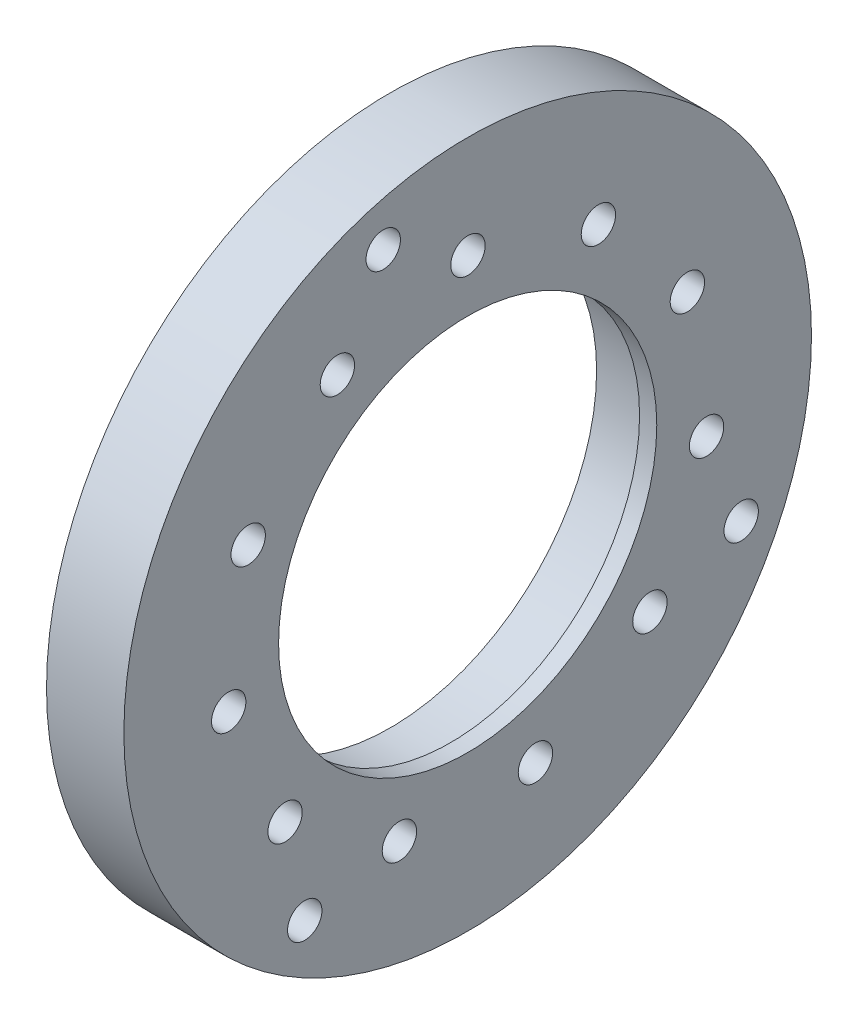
ISO-10303-21;
HEADER;
FILE_DESCRIPTION(('STEP AP214'),'2;1');
FILE_NAME('part.step','',(''),(''),'','','');
FILE_SCHEMA(('AUTOMOTIVE_DESIGN { 1 0 10303 214 1 1 1 1 }'));
ENDSEC;
DATA;
#1=APPLICATION_CONTEXT('core data for automotive mechanical design processes');
#2=APPLICATION_PROTOCOL_DEFINITION('international standard','automotive_design',2000,#1);
#3=PRODUCT_CONTEXT('',#1,'mechanical');
#4=PRODUCT('Part','Part','',(#3));
#5=PRODUCT_RELATED_PRODUCT_CATEGORY('part','',(#4));
#6=PRODUCT_DEFINITION_FORMATION('','',#4);
#7=PRODUCT_DEFINITION_CONTEXT('part definition',#1,'design');
#8=PRODUCT_DEFINITION('design','',#6,#7);
#9=PRODUCT_DEFINITION_SHAPE('','',#8);
#10=(LENGTH_UNIT() NAMED_UNIT(*) SI_UNIT(.MILLI.,.METRE.));
#11=(NAMED_UNIT(*) PLANE_ANGLE_UNIT() SI_UNIT($,.RADIAN.));
#12=(NAMED_UNIT(*) SI_UNIT($,.STERADIAN.) SOLID_ANGLE_UNIT());
#13=UNCERTAINTY_MEASURE_WITH_UNIT(LENGTH_MEASURE(1.E-05),#10,'distance_accuracy_value','');
#14=(GEOMETRIC_REPRESENTATION_CONTEXT(3) GLOBAL_UNCERTAINTY_ASSIGNED_CONTEXT((#13)) GLOBAL_UNIT_ASSIGNED_CONTEXT((#10,
#11,#12)) REPRESENTATION_CONTEXT('',''));
#15=CARTESIAN_POINT('',(0.,0.,0.));
#16=DIRECTION('',(0.,0.,1.));
#17=DIRECTION('',(1.,0.,0.));
#18=AXIS2_PLACEMENT_3D('',#15,#16,#17);
#19=CARTESIAN_POINT('',(63.,40.,0.));
#20=DIRECTION('',(1.,0.,0.));
#21=DIRECTION('',(0.,0.,-1.));
#22=AXIS2_PLACEMENT_3D('',#19,#20,#21);
#23=PLANE('',#22);
#24=CARTESIAN_POINT('',(63.,33.5933023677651,9.82293418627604));
#25=DIRECTION('',(1.,0.,0.));
#26=DIRECTION('',(0.,0.,-1.));
#27=AXIS2_PLACEMENT_3D('',#24,#25,#26);
#28=CIRCLE('',#27,2.);
#29=CARTESIAN_POINT('',(63.,33.5933023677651,7.82293418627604));
#30=VERTEX_POINT('',#29);
#31=EDGE_CURVE('E420',#30,#30,#28,.T.);
#32=ORIENTED_EDGE('',*,*,#31,.F.);
#33=EDGE_LOOP('',(#32));
#34=FACE_BOUND('',#33,.T.);
#35=CARTESIAN_POINT('',(63.,-29.4226129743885,18.9554700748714));
#36=DIRECTION('',(1.,0.,0.));
#37=DIRECTION('',(0.,0.,-1.));
#38=AXIS2_PLACEMENT_3D('',#35,#36,#37);
#39=CIRCLE('',#38,2.);
#40=CARTESIAN_POINT('',(63.,-29.4226129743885,16.9554700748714));
#41=VERTEX_POINT('',#40);
#42=EDGE_CURVE('E432',#41,#41,#39,.T.);
#43=ORIENTED_EDGE('',*,*,#42,.F.);
#44=EDGE_LOOP('',(#43));
#45=FACE_BOUND('',#44,.T.);
#46=CARTESIAN_POINT('',(63.,-14.5752563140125,-31.8207778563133));
#47=DIRECTION('',(1.,0.,0.));
#48=DIRECTION('',(0.,0.,-1.));
#49=AXIS2_PLACEMENT_3D('',#46,#47,#48);
#50=CIRCLE('',#49,2.);
#51=CARTESIAN_POINT('',(63.,-14.5752563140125,-33.8207778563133));
#52=VERTEX_POINT('',#51);
#53=EDGE_CURVE('E444',#52,#52,#50,.T.);
#54=ORIENTED_EDGE('',*,*,#53,.F.);
#55=EDGE_LOOP('',(#54));
#56=FACE_BOUND('',#55,.T.);
#57=CARTESIAN_POINT('',(63.,23.6087778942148,-15.2099163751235));
#58=DIRECTION('',(-1.,0.,0.));
#59=DIRECTION('',(0.,0.,1.));
#60=AXIS2_PLACEMENT_3D('',#57,#58,#59);
#61=CIRCLE('',#60,2.);
#62=CARTESIAN_POINT('',(63.,23.6087778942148,-13.2099163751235));
#63=VERTEX_POINT('',#62);
#64=EDGE_CURVE('E450',#63,#63,#61,.T.);
#65=ORIENTED_EDGE('',*,*,#64,.T.);
#66=EDGE_LOOP('',(#65));
#67=FACE_BOUND('',#66,.T.);
#68=CARTESIAN_POINT('',(63.,11.6378661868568,-25.5592648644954));
#69=DIRECTION('',(-1.,0.,0.));
#70=DIRECTION('',(0.,0.,1.));
#71=AXIS2_PLACEMENT_3D('',#68,#69,#70);
#72=CIRCLE('',#71,2.00000000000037);
#73=CARTESIAN_POINT('',(63.,11.6378661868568,-23.559264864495));
#74=VERTEX_POINT('',#73);
#75=EDGE_CURVE('E456',#74,#74,#72,.T.);
#76=ORIENTED_EDGE('',*,*,#75,.T.);
#77=EDGE_LOOP('',(#76));
#78=FACE_BOUND('',#77,.T.);
#79=CARTESIAN_POINT('',(63.,-4.02798580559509,-27.7937273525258));
#80=DIRECTION('',(-1.,0.,0.));
#81=DIRECTION('',(0.,0.,1.));
#82=AXIS2_PLACEMENT_3D('',#79,#80,#81);
#83=CIRCLE('',#82,2.00000000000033);
#84=CARTESIAN_POINT('',(63.,-4.02798580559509,-25.7937273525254));
#85=VERTEX_POINT('',#84);
#86=EDGE_CURVE('E462',#85,#85,#83,.T.);
#87=ORIENTED_EDGE('',*,*,#86,.T.);
#88=EDGE_LOOP('',(#87));
#89=FACE_BOUND('',#88,.T.);
#90=CARTESIAN_POINT('',(63.,-18.4149807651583,-21.2038777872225));
#91=DIRECTION('',(-1.,0.,0.));
#92=DIRECTION('',(0.,0.,1.));
#93=AXIS2_PLACEMENT_3D('',#90,#91,#92);
#94=CIRCLE('',#93,2.00000000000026);
#95=CARTESIAN_POINT('',(63.,-18.4149807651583,-19.2038777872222));
#96=VERTEX_POINT('',#95);
#97=EDGE_CURVE('E468',#96,#96,#94,.T.);
#98=ORIENTED_EDGE('',*,*,#97,.T.);
#99=EDGE_LOOP('',(#98));
#100=FACE_BOUND('',#99,.T.);
#101=CARTESIAN_POINT('',(63.,-26.9553494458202,-7.88194684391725));
#102=DIRECTION('',(-1.,0.,0.));
#103=DIRECTION('',(0.,0.,1.));
#104=AXIS2_PLACEMENT_3D('',#101,#102,#103);
#105=CIRCLE('',#104,2.00000000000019);
#106=CARTESIAN_POINT('',(63.,-26.9553494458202,-5.88194684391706));
#107=VERTEX_POINT('',#106);
#108=EDGE_CURVE('E474',#107,#107,#105,.T.);
#109=ORIENTED_EDGE('',*,*,#108,.T.);
#110=EDGE_LOOP('',(#109));
#111=FACE_BOUND('',#110,.T.);
#112=CARTESIAN_POINT('',(63.,-26.9375851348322,7.94244653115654));
#113=DIRECTION('',(-1.,0.,0.));
#114=DIRECTION('',(0.,0.,1.));
#115=AXIS2_PLACEMENT_3D('',#112,#113,#114);
#116=CIRCLE('',#115,2.00000000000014);
#117=CARTESIAN_POINT('',(63.,-26.9375851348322,9.94244653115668));
#118=VERTEX_POINT('',#117);
#119=EDGE_CURVE('E480',#118,#118,#116,.T.);
#120=ORIENTED_EDGE('',*,*,#119,.T.);
#121=EDGE_LOOP('',(#120));
#122=FACE_BOUND('',#121,.T.);
#123=CARTESIAN_POINT('',(63.,-18.3673278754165,21.2451692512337));
#124=DIRECTION('',(-1.,0.,0.));
#125=DIRECTION('',(0.,0.,1.));
#126=AXIS2_PLACEMENT_3D('',#123,#124,#125);
#127=CIRCLE('',#126,2.00000000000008);
#128=CARTESIAN_POINT('',(63.,-18.3673278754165,23.2451692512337));
#129=VERTEX_POINT('',#128);
#130=EDGE_CURVE('E486',#129,#129,#127,.T.);
#131=ORIENTED_EDGE('',*,*,#130,.T.);
#132=EDGE_LOOP('',(#131));
#133=FACE_BOUND('',#132,.T.);
#134=CARTESIAN_POINT('',(63.,-3.96557379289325,27.8027008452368));
#135=DIRECTION('',(-1.,0.,0.));
#136=DIRECTION('',(0.,0.,1.));
#137=AXIS2_PLACEMENT_3D('',#134,#135,#136);
#138=CIRCLE('',#137,2.00000000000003);
#139=CARTESIAN_POINT('',(63.,-3.96557379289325,29.8027008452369));
#140=VERTEX_POINT('',#139);
#141=EDGE_CURVE('E492',#140,#140,#138,.T.);
#142=ORIENTED_EDGE('',*,*,#141,.T.);
#143=EDGE_LOOP('',(#142));
#144=FACE_BOUND('',#143,.T.);
#145=CARTESIAN_POINT('',(63.,11.6952219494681,25.5330713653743));
#146=DIRECTION('',(-1.,0.,0.));
#147=DIRECTION('',(0.,0.,1.));
#148=AXIS2_PLACEMENT_3D('',#145,#146,#147);
#149=CIRCLE('',#148,2.00000000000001);
#150=CARTESIAN_POINT('',(63.,11.6952219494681,27.5330713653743));
#151=VERTEX_POINT('',#150);
#152=EDGE_CURVE('E498',#151,#151,#149,.T.);
#153=ORIENTED_EDGE('',*,*,#152,.T.);
#154=EDGE_LOOP('',(#153));
#155=FACE_BOUND('',#154,.T.);
#156=CARTESIAN_POINT('',(63.,23.6428673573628,15.1568721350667));
#157=DIRECTION('',(-1.,0.,0.));
#158=DIRECTION('',(0.,0.,1.));
#159=AXIS2_PLACEMENT_3D('',#156,#157,#158);
#160=CIRCLE('',#159,2.);
#161=CARTESIAN_POINT('',(63.,23.6428673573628,17.1568721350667));
#162=VERTEX_POINT('',#161);
#163=EDGE_CURVE('E504',#162,#162,#160,.T.);
#164=ORIENTED_EDGE('',*,*,#163,.T.);
#165=EDGE_LOOP('',(#164));
#166=FACE_BOUND('',#165,.T.);
#167=CARTESIAN_POINT('',(63.,28.0840694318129,-0.0315269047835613));
#168=DIRECTION('',(-1.,0.,0.));
#169=DIRECTION('',(0.,0.,1.));
#170=AXIS2_PLACEMENT_3D('',#167,#168,#169);
#171=CIRCLE('',#170,2.);
#172=CARTESIAN_POINT('',(63.,28.0840694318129,1.96847309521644));
#173=VERTEX_POINT('',#172);
#174=EDGE_CURVE('E510',#173,#173,#171,.T.);
#175=ORIENTED_EDGE('',*,*,#174,.T.);
#176=EDGE_LOOP('',(#175));
#177=FACE_BOUND('',#176,.T.);
#178=CARTESIAN_POINT('',(63.,0.,0.));
#179=DIRECTION('',(1.,0.,0.));
#180=DIRECTION('',(0.,0.,-1.));
#181=AXIS2_PLACEMENT_3D('',#178,#179,#180);
#182=CIRCLE('',#181,40.);
#183=CARTESIAN_POINT('',(63.,0.,-40.));
#184=VERTEX_POINT('',#183);
#185=EDGE_CURVE('E11',#184,#184,#182,.T.);
#186=ORIENTED_EDGE('',*,*,#185,.T.);
#187=EDGE_LOOP('',(#186));
#188=FACE_BOUND('',#187,.T.);
#189=CARTESIAN_POINT('',(63.,0.,0.));
#190=DIRECTION('',(1.,0.,0.));
#191=DIRECTION('',(0.,0.,-1.));
#192=AXIS2_PLACEMENT_3D('',#189,#190,#191);
#193=CIRCLE('',#192,22.);
#194=CARTESIAN_POINT('',(63.,0.,-22.));
#195=VERTEX_POINT('',#194);
#196=EDGE_CURVE('E513',#195,#195,#193,.T.);
#197=ORIENTED_EDGE('',*,*,#196,.F.);
#198=EDGE_LOOP('',(#197));
#199=FACE_BOUND('',#198,.T.);
#200=ADVANCED_FACE('F368',(#34,#45,#56,#67,#78,#89,#100,#111,#122,#133,#144,#155,#166,#177,#188,
#199),#23,.T.);
#201=CARTESIAN_POINT('',(53.,0.,0.));
#202=DIRECTION('',(1.,0.,0.));
#203=DIRECTION('',(0.,0.,-1.));
#204=AXIS2_PLACEMENT_3D('',#201,#202,#203);
#205=CYLINDRICAL_SURFACE('',#204,40.);
#206=CARTESIAN_POINT('',(54.,0.,0.));
#207=DIRECTION('',(1.,0.,0.));
#208=DIRECTION('',(0.,0.,-1.));
#209=AXIS2_PLACEMENT_3D('',#206,#207,#208);
#210=CIRCLE('',#209,40.);
#211=CARTESIAN_POINT('',(54.,0.,-40.));
#212=VERTEX_POINT('',#211);
#213=EDGE_CURVE('E375',#212,#212,#210,.T.);
#214=ORIENTED_EDGE('',*,*,#213,.T.);
#215=EDGE_LOOP('',(#214));
#216=FACE_BOUND('',#215,.T.);
#217=ORIENTED_EDGE('',*,*,#185,.F.);
#218=EDGE_LOOP('',(#217));
#219=FACE_BOUND('',#218,.T.);
#220=ADVANCED_FACE('F527',(#216,#219),#205,.T.);
#221=CARTESIAN_POINT('',(54.,40.,0.));
#222=DIRECTION('',(-1.,0.,0.));
#223=DIRECTION('',(0.,0.,1.));
#224=AXIS2_PLACEMENT_3D('',#221,#222,#223);
#225=PLANE('',#224);
#226=CARTESIAN_POINT('',(54.,26.9098547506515,-26.1172302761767));
#227=DIRECTION('',(-1.,0.,0.));
#228=DIRECTION('',(0.,0.,1.));
#229=AXIS2_PLACEMENT_3D('',#226,#227,#228);
#230=CIRCLE('',#229,1.25);
#231=CARTESIAN_POINT('',(54.,26.9098547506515,-24.8672302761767));
#232=VERTEX_POINT('',#231);
#233=EDGE_CURVE('E394',#232,#232,#230,.T.);
#234=ORIENTED_EDGE('',*,*,#233,.F.);
#235=EDGE_LOOP('',(#234));
#236=FACE_BOUND('',#235,.T.);
#237=CARTESIAN_POINT('',(54.,-18.4617424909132,32.6406811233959));
#238=DIRECTION('',(-1.,0.,0.));
#239=DIRECTION('',(0.,0.,1.));
#240=AXIS2_PLACEMENT_3D('',#237,#238,#239);
#241=CIRCLE('',#240,1.25);
#242=CARTESIAN_POINT('',(54.,-18.4617424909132,33.8906811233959));
#243=VERTEX_POINT('',#242);
#244=EDGE_CURVE('E402',#243,#243,#241,.T.);
#245=ORIENTED_EDGE('',*,*,#244,.F.);
#246=EDGE_LOOP('',(#245));
#247=FACE_BOUND('',#246,.T.);
#248=CARTESIAN_POINT('',(54.,-29.6810661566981,-22.9190818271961));
#249=DIRECTION('',(-1.,0.,0.));
#250=DIRECTION('',(0.,0.,1.));
#251=AXIS2_PLACEMENT_3D('',#248,#249,#250);
#252=CIRCLE('',#251,1.25);
#253=CARTESIAN_POINT('',(54.,-29.6810661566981,-21.6690818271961));
#254=VERTEX_POINT('',#253);
#255=EDGE_CURVE('E408',#254,#254,#252,.T.);
#256=ORIENTED_EDGE('',*,*,#255,.F.);
#257=EDGE_LOOP('',(#256));
#258=FACE_BOUND('',#257,.T.);
#259=CARTESIAN_POINT('',(54.,33.5933023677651,9.82293418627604));
#260=DIRECTION('',(-1.,0.,0.));
#261=DIRECTION('',(0.,0.,1.));
#262=AXIS2_PLACEMENT_3D('',#259,#260,#261);
#263=CIRCLE('',#262,3.25);
#264=CARTESIAN_POINT('',(54.,33.5933023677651,13.072934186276));
#265=VERTEX_POINT('',#264);
#266=EDGE_CURVE('E417',#265,#265,#263,.T.);
#267=ORIENTED_EDGE('',*,*,#266,.F.);
#268=EDGE_LOOP('',(#267));
#269=FACE_BOUND('',#268,.T.);
#270=CARTESIAN_POINT('',(54.,-29.4226129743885,18.9554700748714));
#271=DIRECTION('',(-1.,0.,0.));
#272=DIRECTION('',(0.,0.,1.));
#273=AXIS2_PLACEMENT_3D('',#270,#271,#272);
#274=CIRCLE('',#273,3.25);
#275=CARTESIAN_POINT('',(54.,-29.4226129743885,22.2054700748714));
#276=VERTEX_POINT('',#275);
#277=EDGE_CURVE('E429',#276,#276,#274,.T.);
#278=ORIENTED_EDGE('',*,*,#277,.F.);
#279=EDGE_LOOP('',(#278));
#280=FACE_BOUND('',#279,.T.);
#281=CARTESIAN_POINT('',(54.,-14.5752563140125,-31.8207778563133));
#282=DIRECTION('',(-1.,0.,0.));
#283=DIRECTION('',(0.,0.,1.));
#284=AXIS2_PLACEMENT_3D('',#281,#282,#283);
#285=CIRCLE('',#284,3.25);
#286=CARTESIAN_POINT('',(54.,-14.5752563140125,-28.5707778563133));
#287=VERTEX_POINT('',#286);
#288=EDGE_CURVE('E441',#287,#287,#285,.T.);
#289=ORIENTED_EDGE('',*,*,#288,.F.);
#290=EDGE_LOOP('',(#289));
#291=FACE_BOUND('',#290,.T.);
#292=CARTESIAN_POINT('',(54.,23.6087778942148,-15.2099163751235));
#293=DIRECTION('',(-1.,0.,0.));
#294=DIRECTION('',(0.,0.,1.));
#295=AXIS2_PLACEMENT_3D('',#292,#293,#294);
#296=CIRCLE('',#295,2.);
#297=CARTESIAN_POINT('',(54.,23.6087778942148,-13.2099163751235));
#298=VERTEX_POINT('',#297);
#299=EDGE_CURVE('E447',#298,#298,#296,.T.);
#300=ORIENTED_EDGE('',*,*,#299,.F.);
#301=EDGE_LOOP('',(#300));
#302=FACE_BOUND('',#301,.T.);
#303=CARTESIAN_POINT('',(54.,11.6378661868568,-25.5592648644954));
#304=DIRECTION('',(-1.,0.,0.));
#305=DIRECTION('',(0.,0.,1.));
#306=AXIS2_PLACEMENT_3D('',#303,#304,#305);
#307=CIRCLE('',#306,2.00000000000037);
#308=CARTESIAN_POINT('',(54.,11.6378661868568,-23.559264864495));
#309=VERTEX_POINT('',#308);
#310=EDGE_CURVE('E453',#309,#309,#307,.T.);
#311=ORIENTED_EDGE('',*,*,#310,.F.);
#312=EDGE_LOOP('',(#311));
#313=FACE_BOUND('',#312,.T.);
#314=CARTESIAN_POINT('',(54.,-4.02798580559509,-27.7937273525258));
#315=DIRECTION('',(-1.,0.,0.));
#316=DIRECTION('',(0.,0.,1.));
#317=AXIS2_PLACEMENT_3D('',#314,#315,#316);
#318=CIRCLE('',#317,2.00000000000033);
#319=CARTESIAN_POINT('',(54.,-4.02798580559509,-25.7937273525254));
#320=VERTEX_POINT('',#319);
#321=EDGE_CURVE('E459',#320,#320,#318,.T.);
#322=ORIENTED_EDGE('',*,*,#321,.F.);
#323=EDGE_LOOP('',(#322));
#324=FACE_BOUND('',#323,.T.);
#325=CARTESIAN_POINT('',(54.,-18.4149807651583,-21.2038777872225));
#326=DIRECTION('',(-1.,0.,0.));
#327=DIRECTION('',(0.,0.,1.));
#328=AXIS2_PLACEMENT_3D('',#325,#326,#327);
#329=CIRCLE('',#328,2.00000000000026);
#330=CARTESIAN_POINT('',(54.,-18.4149807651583,-19.2038777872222));
#331=VERTEX_POINT('',#330);
#332=EDGE_CURVE('E465',#331,#331,#329,.T.);
#333=ORIENTED_EDGE('',*,*,#332,.F.);
#334=EDGE_LOOP('',(#333));
#335=FACE_BOUND('',#334,.T.);
#336=CARTESIAN_POINT('',(54.,-26.9553494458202,-7.88194684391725));
#337=DIRECTION('',(-1.,0.,0.));
#338=DIRECTION('',(0.,0.,1.));
#339=AXIS2_PLACEMENT_3D('',#336,#337,#338);
#340=CIRCLE('',#339,2.00000000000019);
#341=CARTESIAN_POINT('',(54.,-26.9553494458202,-5.88194684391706));
#342=VERTEX_POINT('',#341);
#343=EDGE_CURVE('E471',#342,#342,#340,.T.);
#344=ORIENTED_EDGE('',*,*,#343,.F.);
#345=EDGE_LOOP('',(#344));
#346=FACE_BOUND('',#345,.T.);
#347=CARTESIAN_POINT('',(54.,-26.9375851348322,7.94244653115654));
#348=DIRECTION('',(-1.,0.,0.));
#349=DIRECTION('',(0.,0.,1.));
#350=AXIS2_PLACEMENT_3D('',#347,#348,#349);
#351=CIRCLE('',#350,2.00000000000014);
#352=CARTESIAN_POINT('',(54.,-26.9375851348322,9.94244653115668));
#353=VERTEX_POINT('',#352);
#354=EDGE_CURVE('E477',#353,#353,#351,.T.);
#355=ORIENTED_EDGE('',*,*,#354,.F.);
#356=EDGE_LOOP('',(#355));
#357=FACE_BOUND('',#356,.T.);
#358=CARTESIAN_POINT('',(54.,-18.3673278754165,21.2451692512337));
#359=DIRECTION('',(-1.,0.,0.));
#360=DIRECTION('',(0.,0.,1.));
#361=AXIS2_PLACEMENT_3D('',#358,#359,#360);
#362=CIRCLE('',#361,2.00000000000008);
#363=CARTESIAN_POINT('',(54.,-18.3673278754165,23.2451692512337));
#364=VERTEX_POINT('',#363);
#365=EDGE_CURVE('E483',#364,#364,#362,.T.);
#366=ORIENTED_EDGE('',*,*,#365,.F.);
#367=EDGE_LOOP('',(#366));
#368=FACE_BOUND('',#367,.T.);
#369=CARTESIAN_POINT('',(54.,-3.96557379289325,27.8027008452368));
#370=DIRECTION('',(-1.,0.,0.));
#371=DIRECTION('',(0.,0.,1.));
#372=AXIS2_PLACEMENT_3D('',#369,#370,#371);
#373=CIRCLE('',#372,2.00000000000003);
#374=CARTESIAN_POINT('',(54.,-3.96557379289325,29.8027008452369));
#375=VERTEX_POINT('',#374);
#376=EDGE_CURVE('E489',#375,#375,#373,.T.);
#377=ORIENTED_EDGE('',*,*,#376,.F.);
#378=EDGE_LOOP('',(#377));
#379=FACE_BOUND('',#378,.T.);
#380=CARTESIAN_POINT('',(54.,11.6952219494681,25.5330713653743));
#381=DIRECTION('',(-1.,0.,0.));
#382=DIRECTION('',(0.,0.,1.));
#383=AXIS2_PLACEMENT_3D('',#380,#381,#382);
#384=CIRCLE('',#383,2.00000000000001);
#385=CARTESIAN_POINT('',(54.,11.6952219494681,27.5330713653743));
#386=VERTEX_POINT('',#385);
#387=EDGE_CURVE('E495',#386,#386,#384,.T.);
#388=ORIENTED_EDGE('',*,*,#387,.F.);
#389=EDGE_LOOP('',(#388));
#390=FACE_BOUND('',#389,.T.);
#391=CARTESIAN_POINT('',(54.,23.6428673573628,15.1568721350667));
#392=DIRECTION('',(-1.,0.,0.));
#393=DIRECTION('',(0.,0.,1.));
#394=AXIS2_PLACEMENT_3D('',#391,#392,#393);
#395=CIRCLE('',#394,2.);
#396=CARTESIAN_POINT('',(54.,23.6428673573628,17.1568721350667));
#397=VERTEX_POINT('',#396);
#398=EDGE_CURVE('E501',#397,#397,#395,.T.);
#399=ORIENTED_EDGE('',*,*,#398,.F.);
#400=EDGE_LOOP('',(#399));
#401=FACE_BOUND('',#400,.T.);
#402=CARTESIAN_POINT('',(54.,28.0840694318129,-0.0315269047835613));
#403=DIRECTION('',(-1.,0.,0.));
#404=DIRECTION('',(0.,0.,1.));
#405=AXIS2_PLACEMENT_3D('',#402,#403,#404);
#406=CIRCLE('',#405,2.);
#407=CARTESIAN_POINT('',(54.,28.0840694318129,1.96847309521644));
#408=VERTEX_POINT('',#407);
#409=EDGE_CURVE('E507',#408,#408,#406,.T.);
#410=ORIENTED_EDGE('',*,*,#409,.F.);
#411=EDGE_LOOP('',(#410));
#412=FACE_BOUND('',#411,.T.);
#413=CARTESIAN_POINT('',(54.,0.,0.));
#414=DIRECTION('',(1.,0.,0.));
#415=DIRECTION('',(0.,0.,-1.));
#416=AXIS2_PLACEMENT_3D('',#413,#414,#415);
#417=CIRCLE('',#416,24.);
#418=CARTESIAN_POINT('',(54.,0.,-24.));
#419=VERTEX_POINT('',#418);
#420=EDGE_CURVE('E522',#419,#419,#417,.T.);
#421=ORIENTED_EDGE('',*,*,#420,.T.);
#422=EDGE_LOOP('',(#421));
#423=FACE_BOUND('',#422,.T.);
#424=ORIENTED_EDGE('',*,*,#213,.F.);
#425=EDGE_LOOP('',(#424));
#426=FACE_BOUND('',#425,.T.);
#427=ADVANCED_FACE('F530',(#236,#247,#258,#269,#280,#291,#302,#313,#324,#335,#346,#357,#368,
#379,#390,#401,#412,#423,#426),#225,.T.);
#428=CARTESIAN_POINT('',(53.,0.,0.));
#429=DIRECTION('',(1.,0.,0.));
#430=DIRECTION('',(0.,0.,-1.));
#431=AXIS2_PLACEMENT_3D('',#428,#429,#430);
#432=CYLINDRICAL_SURFACE('',#431,24.);
#433=CARTESIAN_POINT('',(61.,0.,0.));
#434=DIRECTION('',(1.,0.,0.));
#435=DIRECTION('',(0.,0.,-1.));
#436=AXIS2_PLACEMENT_3D('',#433,#434,#435);
#437=CIRCLE('',#436,24.);
#438=CARTESIAN_POINT('',(61.,0.,-24.));
#439=VERTEX_POINT('',#438);
#440=EDGE_CURVE('E519',#439,#439,#437,.T.);
#441=ORIENTED_EDGE('',*,*,#440,.T.);
#442=EDGE_LOOP('',(#441));
#443=FACE_BOUND('',#442,.T.);
#444=ORIENTED_EDGE('',*,*,#420,.F.);
#445=EDGE_LOOP('',(#444));
#446=FACE_BOUND('',#445,.T.);
#447=ADVANCED_FACE('F532',(#443,#446),#432,.F.);
#448=CARTESIAN_POINT('',(61.,24.,0.));
#449=DIRECTION('',(-1.,0.,0.));
#450=DIRECTION('',(0.,0.,1.));
#451=AXIS2_PLACEMENT_3D('',#448,#449,#450);
#452=PLANE('',#451);
#453=CARTESIAN_POINT('',(61.,0.,0.));
#454=DIRECTION('',(1.,0.,0.));
#455=DIRECTION('',(0.,0.,-1.));
#456=AXIS2_PLACEMENT_3D('',#453,#454,#455);
#457=CIRCLE('',#456,22.);
#458=CARTESIAN_POINT('',(61.,0.,-22.));
#459=VERTEX_POINT('',#458);
#460=EDGE_CURVE('E516',#459,#459,#457,.T.);
#461=ORIENTED_EDGE('',*,*,#460,.T.);
#462=EDGE_LOOP('',(#461));
#463=FACE_BOUND('',#462,.T.);
#464=ORIENTED_EDGE('',*,*,#440,.F.);
#465=EDGE_LOOP('',(#464));
#466=FACE_BOUND('',#465,.T.);
#467=ADVANCED_FACE('F540',(#463,#466),#452,.T.);
#468=CARTESIAN_POINT('',(53.,0.,0.));
#469=DIRECTION('',(1.,0.,0.));
#470=DIRECTION('',(0.,0.,-1.));
#471=AXIS2_PLACEMENT_3D('',#468,#469,#470);
#472=CYLINDRICAL_SURFACE('',#471,22.);
#473=ORIENTED_EDGE('',*,*,#196,.T.);
#474=EDGE_LOOP('',(#473));
#475=FACE_BOUND('',#474,.T.);
#476=ORIENTED_EDGE('',*,*,#460,.F.);
#477=EDGE_LOOP('',(#476));
#478=FACE_BOUND('',#477,.T.);
#479=ADVANCED_FACE('F584',(#475,#478),#472,.F.);
#480=CARTESIAN_POINT('',(63.,28.0840694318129,-0.0315269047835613));
#481=DIRECTION('',(-1.,0.,0.));
#482=DIRECTION('',(0.,0.,1.));
#483=AXIS2_PLACEMENT_3D('',#480,#481,#482);
#484=CYLINDRICAL_SURFACE('',#483,2.);
#485=ORIENTED_EDGE('',*,*,#174,.F.);
#486=EDGE_LOOP('',(#485));
#487=FACE_BOUND('',#486,.T.);
#488=ORIENTED_EDGE('',*,*,#409,.T.);
#489=EDGE_LOOP('',(#488));
#490=FACE_BOUND('',#489,.T.);
#491=ADVANCED_FACE('F587',(#487,#490),#484,.F.);
#492=CARTESIAN_POINT('',(63.,23.6428673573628,15.1568721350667));
#493=DIRECTION('',(-1.,0.,0.));
#494=DIRECTION('',(0.,0.,1.));
#495=AXIS2_PLACEMENT_3D('',#492,#493,#494);
#496=CYLINDRICAL_SURFACE('',#495,2.);
#497=ORIENTED_EDGE('',*,*,#163,.F.);
#498=EDGE_LOOP('',(#497));
#499=FACE_BOUND('',#498,.T.);
#500=ORIENTED_EDGE('',*,*,#398,.T.);
#501=EDGE_LOOP('',(#500));
#502=FACE_BOUND('',#501,.T.);
#503=ADVANCED_FACE('F603',(#499,#502),#496,.F.);
#504=CARTESIAN_POINT('',(63.,11.6952219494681,25.5330713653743));
#505=DIRECTION('',(-1.,0.,0.));
#506=DIRECTION('',(0.,0.,1.));
#507=AXIS2_PLACEMENT_3D('',#504,#505,#506);
#508=CYLINDRICAL_SURFACE('',#507,2.00000000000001);
#509=ORIENTED_EDGE('',*,*,#152,.F.);
#510=EDGE_LOOP('',(#509));
#511=FACE_BOUND('',#510,.T.);
#512=ORIENTED_EDGE('',*,*,#387,.T.);
#513=EDGE_LOOP('',(#512));
#514=FACE_BOUND('',#513,.T.);
#515=ADVANCED_FACE('F607',(#511,#514),#508,.F.);
#516=CARTESIAN_POINT('',(63.,-3.96557379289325,27.8027008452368));
#517=DIRECTION('',(-1.,0.,0.));
#518=DIRECTION('',(0.,0.,1.));
#519=AXIS2_PLACEMENT_3D('',#516,#517,#518);
#520=CYLINDRICAL_SURFACE('',#519,2.00000000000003);
#521=ORIENTED_EDGE('',*,*,#141,.F.);
#522=EDGE_LOOP('',(#521));
#523=FACE_BOUND('',#522,.T.);
#524=ORIENTED_EDGE('',*,*,#376,.T.);
#525=EDGE_LOOP('',(#524));
#526=FACE_BOUND('',#525,.T.);
#527=ADVANCED_FACE('F611',(#523,#526),#520,.F.);
#528=CARTESIAN_POINT('',(63.,-18.3673278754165,21.2451692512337));
#529=DIRECTION('',(-1.,0.,0.));
#530=DIRECTION('',(0.,0.,1.));
#531=AXIS2_PLACEMENT_3D('',#528,#529,#530);
#532=CYLINDRICAL_SURFACE('',#531,2.00000000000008);
#533=ORIENTED_EDGE('',*,*,#130,.F.);
#534=EDGE_LOOP('',(#533));
#535=FACE_BOUND('',#534,.T.);
#536=ORIENTED_EDGE('',*,*,#365,.T.);
#537=EDGE_LOOP('',(#536));
#538=FACE_BOUND('',#537,.T.);
#539=ADVANCED_FACE('F615',(#535,#538),#532,.F.);
#540=CARTESIAN_POINT('',(63.,-26.9375851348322,7.94244653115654));
#541=DIRECTION('',(-1.,0.,0.));
#542=DIRECTION('',(0.,0.,1.));
#543=AXIS2_PLACEMENT_3D('',#540,#541,#542);
#544=CYLINDRICAL_SURFACE('',#543,2.00000000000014);
#545=ORIENTED_EDGE('',*,*,#119,.F.);
#546=EDGE_LOOP('',(#545));
#547=FACE_BOUND('',#546,.T.);
#548=ORIENTED_EDGE('',*,*,#354,.T.);
#549=EDGE_LOOP('',(#548));
#550=FACE_BOUND('',#549,.T.);
#551=ADVANCED_FACE('F619',(#547,#550),#544,.F.);
#552=CARTESIAN_POINT('',(63.,-26.9553494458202,-7.88194684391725));
#553=DIRECTION('',(-1.,0.,0.));
#554=DIRECTION('',(0.,0.,1.));
#555=AXIS2_PLACEMENT_3D('',#552,#553,#554);
#556=CYLINDRICAL_SURFACE('',#555,2.00000000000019);
#557=ORIENTED_EDGE('',*,*,#108,.F.);
#558=EDGE_LOOP('',(#557));
#559=FACE_BOUND('',#558,.T.);
#560=ORIENTED_EDGE('',*,*,#343,.T.);
#561=EDGE_LOOP('',(#560));
#562=FACE_BOUND('',#561,.T.);
#563=ADVANCED_FACE('F623',(#559,#562),#556,.F.);
#564=CARTESIAN_POINT('',(63.,-18.4149807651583,-21.2038777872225));
#565=DIRECTION('',(-1.,0.,0.));
#566=DIRECTION('',(0.,0.,1.));
#567=AXIS2_PLACEMENT_3D('',#564,#565,#566);
#568=CYLINDRICAL_SURFACE('',#567,2.00000000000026);
#569=ORIENTED_EDGE('',*,*,#97,.F.);
#570=EDGE_LOOP('',(#569));
#571=FACE_BOUND('',#570,.T.);
#572=ORIENTED_EDGE('',*,*,#332,.T.);
#573=EDGE_LOOP('',(#572));
#574=FACE_BOUND('',#573,.T.);
#575=ADVANCED_FACE('F627',(#571,#574),#568,.F.);
#576=CARTESIAN_POINT('',(63.,-4.02798580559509,-27.7937273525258));
#577=DIRECTION('',(-1.,0.,0.));
#578=DIRECTION('',(0.,0.,1.));
#579=AXIS2_PLACEMENT_3D('',#576,#577,#578);
#580=CYLINDRICAL_SURFACE('',#579,2.00000000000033);
#581=ORIENTED_EDGE('',*,*,#86,.F.);
#582=EDGE_LOOP('',(#581));
#583=FACE_BOUND('',#582,.T.);
#584=ORIENTED_EDGE('',*,*,#321,.T.);
#585=EDGE_LOOP('',(#584));
#586=FACE_BOUND('',#585,.T.);
#587=ADVANCED_FACE('F631',(#583,#586),#580,.F.);
#588=CARTESIAN_POINT('',(63.,11.6378661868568,-25.5592648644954));
#589=DIRECTION('',(-1.,0.,0.));
#590=DIRECTION('',(0.,0.,1.));
#591=AXIS2_PLACEMENT_3D('',#588,#589,#590);
#592=CYLINDRICAL_SURFACE('',#591,2.00000000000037);
#593=ORIENTED_EDGE('',*,*,#75,.F.);
#594=EDGE_LOOP('',(#593));
#595=FACE_BOUND('',#594,.T.);
#596=ORIENTED_EDGE('',*,*,#310,.T.);
#597=EDGE_LOOP('',(#596));
#598=FACE_BOUND('',#597,.T.);
#599=ADVANCED_FACE('F635',(#595,#598),#592,.F.);
#600=CARTESIAN_POINT('',(63.,23.6087778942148,-15.2099163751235));
#601=DIRECTION('',(-1.,0.,0.));
#602=DIRECTION('',(0.,0.,1.));
#603=AXIS2_PLACEMENT_3D('',#600,#601,#602);
#604=CYLINDRICAL_SURFACE('',#603,2.);
#605=ORIENTED_EDGE('',*,*,#64,.F.);
#606=EDGE_LOOP('',(#605));
#607=FACE_BOUND('',#606,.T.);
#608=ORIENTED_EDGE('',*,*,#299,.T.);
#609=EDGE_LOOP('',(#608));
#610=FACE_BOUND('',#609,.T.);
#611=ADVANCED_FACE('F639',(#607,#610),#604,.F.);
#612=CARTESIAN_POINT('',(54.,-14.5752563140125,-31.8207778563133));
#613=DIRECTION('',(-1.,0.,0.));
#614=DIRECTION('',(0.,0.,1.));
#615=AXIS2_PLACEMENT_3D('',#612,#613,#614);
#616=CYLINDRICAL_SURFACE('',#615,2.);
#617=CARTESIAN_POINT('',(57.,-14.5752563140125,-31.8207778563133));
#618=DIRECTION('',(-1.,0.,0.));
#619=DIRECTION('',(0.,0.,1.));
#620=AXIS2_PLACEMENT_3D('',#617,#618,#619);
#621=CIRCLE('',#620,2.);
#622=CARTESIAN_POINT('',(57.,-14.5752563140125,-29.8207778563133));
#623=VERTEX_POINT('',#622);
#624=EDGE_CURVE('E435',#623,#623,#621,.T.);
#625=ORIENTED_EDGE('',*,*,#624,.T.);
#626=EDGE_LOOP('',(#625));
#627=FACE_BOUND('',#626,.T.);
#628=ORIENTED_EDGE('',*,*,#53,.T.);
#629=EDGE_LOOP('',(#628));
#630=FACE_BOUND('',#629,.T.);
#631=ADVANCED_FACE('F642',(#627,#630),#616,.F.);
#632=CARTESIAN_POINT('',(54.,-14.5752563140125,-31.8207778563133));
#633=DIRECTION('',(-1.,0.,0.));
#634=DIRECTION('',(0.,0.,1.));
#635=AXIS2_PLACEMENT_3D('',#632,#633,#634);
#636=CYLINDRICAL_SURFACE('',#635,3.25);
#637=CARTESIAN_POINT('',(57.,-14.5752563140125,-31.8207778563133));
#638=DIRECTION('',(-1.,0.,0.));
#639=DIRECTION('',(0.,0.,1.));
#640=AXIS2_PLACEMENT_3D('',#637,#638,#639);
#641=CIRCLE('',#640,3.25);
#642=CARTESIAN_POINT('',(57.,-14.5752563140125,-28.5707778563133));
#643=VERTEX_POINT('',#642);
#644=EDGE_CURVE('E438',#643,#643,#641,.T.);
#645=ORIENTED_EDGE('',*,*,#644,.F.);
#646=EDGE_LOOP('',(#645));
#647=FACE_BOUND('',#646,.T.);
#648=ORIENTED_EDGE('',*,*,#288,.T.);
#649=EDGE_LOOP('',(#648));
#650=FACE_BOUND('',#649,.T.);
#651=ADVANCED_FACE('F644',(#647,#650),#636,.F.);
#652=CARTESIAN_POINT('',(57.,-12.5752563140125,-31.8207778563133));
#653=DIRECTION('',(1.,0.,0.));
#654=DIRECTION('',(0.,0.,-1.));
#655=AXIS2_PLACEMENT_3D('',#652,#653,#654);
#656=PLANE('',#655);
#657=ORIENTED_EDGE('',*,*,#624,.F.);
#658=EDGE_LOOP('',(#657));
#659=FACE_BOUND('',#658,.T.);
#660=ORIENTED_EDGE('',*,*,#644,.T.);
#661=EDGE_LOOP('',(#660));
#662=FACE_BOUND('',#661,.T.);
#663=ADVANCED_FACE('F647',(#659,#662),#656,.F.);
#664=CARTESIAN_POINT('',(54.,-29.4226129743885,18.9554700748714));
#665=DIRECTION('',(-1.,0.,0.));
#666=DIRECTION('',(0.,0.,1.));
#667=AXIS2_PLACEMENT_3D('',#664,#665,#666);
#668=CYLINDRICAL_SURFACE('',#667,2.);
#669=CARTESIAN_POINT('',(57.,-29.4226129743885,18.9554700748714));
#670=DIRECTION('',(-1.,0.,0.));
#671=DIRECTION('',(0.,0.,1.));
#672=AXIS2_PLACEMENT_3D('',#669,#670,#671);
#673=CIRCLE('',#672,2.);
#674=CARTESIAN_POINT('',(57.,-29.4226129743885,20.9554700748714));
#675=VERTEX_POINT('',#674);
#676=EDGE_CURVE('E423',#675,#675,#673,.T.);
#677=ORIENTED_EDGE('',*,*,#676,.T.);
#678=EDGE_LOOP('',(#677));
#679=FACE_BOUND('',#678,.T.);
#680=ORIENTED_EDGE('',*,*,#42,.T.);
#681=EDGE_LOOP('',(#680));
#682=FACE_BOUND('',#681,.T.);
#683=ADVANCED_FACE('F651',(#679,#682),#668,.F.);
#684=CARTESIAN_POINT('',(54.,-29.4226129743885,18.9554700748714));
#685=DIRECTION('',(-1.,0.,0.));
#686=DIRECTION('',(0.,0.,1.));
#687=AXIS2_PLACEMENT_3D('',#684,#685,#686);
#688=CYLINDRICAL_SURFACE('',#687,3.25);
#689=CARTESIAN_POINT('',(57.,-29.4226129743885,18.9554700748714));
#690=DIRECTION('',(-1.,0.,0.));
#691=DIRECTION('',(0.,0.,1.));
#692=AXIS2_PLACEMENT_3D('',#689,#690,#691);
#693=CIRCLE('',#692,3.25);
#694=CARTESIAN_POINT('',(57.,-29.4226129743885,22.2054700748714));
#695=VERTEX_POINT('',#694);
#696=EDGE_CURVE('E426',#695,#695,#693,.T.);
#697=ORIENTED_EDGE('',*,*,#696,.F.);
#698=EDGE_LOOP('',(#697));
#699=FACE_BOUND('',#698,.T.);
#700=ORIENTED_EDGE('',*,*,#277,.T.);
#701=EDGE_LOOP('',(#700));
#702=FACE_BOUND('',#701,.T.);
#703=ADVANCED_FACE('F655',(#699,#702),#688,.F.);
#704=CARTESIAN_POINT('',(57.,-27.4226129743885,18.9554700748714));
#705=DIRECTION('',(1.,0.,0.));
#706=DIRECTION('',(0.,0.,-1.));
#707=AXIS2_PLACEMENT_3D('',#704,#705,#706);
#708=PLANE('',#707);
#709=ORIENTED_EDGE('',*,*,#676,.F.);
#710=EDGE_LOOP('',(#709));
#711=FACE_BOUND('',#710,.T.);
#712=ORIENTED_EDGE('',*,*,#696,.T.);
#713=EDGE_LOOP('',(#712));
#714=FACE_BOUND('',#713,.T.);
#715=ADVANCED_FACE('F658',(#711,#714),#708,.F.);
#716=CARTESIAN_POINT('',(54.,33.5933023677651,9.82293418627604));
#717=DIRECTION('',(-1.,0.,0.));
#718=DIRECTION('',(0.,0.,1.));
#719=AXIS2_PLACEMENT_3D('',#716,#717,#718);
#720=CYLINDRICAL_SURFACE('',#719,2.);
#721=CARTESIAN_POINT('',(57.,33.5933023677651,9.82293418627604));
#722=DIRECTION('',(-1.,0.,0.));
#723=DIRECTION('',(0.,0.,1.));
#724=AXIS2_PLACEMENT_3D('',#721,#722,#723);
#725=CIRCLE('',#724,2.);
#726=CARTESIAN_POINT('',(57.,33.5933023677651,11.822934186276));
#727=VERTEX_POINT('',#726);
#728=EDGE_CURVE('E411',#727,#727,#725,.T.);
#729=ORIENTED_EDGE('',*,*,#728,.T.);
#730=EDGE_LOOP('',(#729));
#731=FACE_BOUND('',#730,.T.);
#732=ORIENTED_EDGE('',*,*,#31,.T.);
#733=EDGE_LOOP('',(#732));
#734=FACE_BOUND('',#733,.T.);
#735=ADVANCED_FACE('F662',(#731,#734),#720,.F.);
#736=CARTESIAN_POINT('',(54.,33.5933023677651,9.82293418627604));
#737=DIRECTION('',(-1.,0.,0.));
#738=DIRECTION('',(0.,0.,1.));
#739=AXIS2_PLACEMENT_3D('',#736,#737,#738);
#740=CYLINDRICAL_SURFACE('',#739,3.25);
#741=CARTESIAN_POINT('',(57.,33.5933023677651,9.82293418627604));
#742=DIRECTION('',(-1.,0.,0.));
#743=DIRECTION('',(0.,0.,1.));
#744=AXIS2_PLACEMENT_3D('',#741,#742,#743);
#745=CIRCLE('',#744,3.25);
#746=CARTESIAN_POINT('',(57.,33.5933023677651,13.072934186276));
#747=VERTEX_POINT('',#746);
#748=EDGE_CURVE('E414',#747,#747,#745,.T.);
#749=ORIENTED_EDGE('',*,*,#748,.F.);
#750=EDGE_LOOP('',(#749));
#751=FACE_BOUND('',#750,.T.);
#752=ORIENTED_EDGE('',*,*,#266,.T.);
#753=EDGE_LOOP('',(#752));
#754=FACE_BOUND('',#753,.T.);
#755=ADVANCED_FACE('F667',(#751,#754),#740,.F.);
#756=CARTESIAN_POINT('',(57.,35.5933023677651,9.82293418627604));
#757=DIRECTION('',(1.,0.,0.));
#758=DIRECTION('',(0.,0.,-1.));
#759=AXIS2_PLACEMENT_3D('',#756,#757,#758);
#760=PLANE('',#759);
#761=ORIENTED_EDGE('',*,*,#728,.F.);
#762=EDGE_LOOP('',(#761));
#763=FACE_BOUND('',#762,.T.);
#764=ORIENTED_EDGE('',*,*,#748,.T.);
#765=EDGE_LOOP('',(#764));
#766=FACE_BOUND('',#765,.T.);
#767=ADVANCED_FACE('F670',(#763,#766),#760,.F.);
#768=CARTESIAN_POINT('',(54.,-29.6810661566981,-22.9190818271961));
#769=DIRECTION('',(-1.,0.,0.));
#770=DIRECTION('',(0.,0.,1.));
#771=AXIS2_PLACEMENT_3D('',#768,#769,#770);
#772=CYLINDRICAL_SURFACE('',#771,1.25);
#773=CARTESIAN_POINT('',(59.,-29.6810661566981,-22.9190818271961));
#774=DIRECTION('',(-1.,0.,0.));
#775=DIRECTION('',(0.,0.,1.));
#776=AXIS2_PLACEMENT_3D('',#773,#774,#775);
#777=CIRCLE('',#776,1.25);
#778=CARTESIAN_POINT('',(59.,-29.6810661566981,-21.6690818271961));
#779=VERTEX_POINT('',#778);
#780=EDGE_CURVE('E405',#779,#779,#777,.T.);
#781=ORIENTED_EDGE('',*,*,#780,.F.);
#782=EDGE_LOOP('',(#781));
#783=FACE_BOUND('',#782,.T.);
#784=ORIENTED_EDGE('',*,*,#255,.T.);
#785=EDGE_LOOP('',(#784));
#786=FACE_BOUND('',#785,.T.);
#787=ADVANCED_FACE('F673',(#783,#786),#772,.F.);
#788=CARTESIAN_POINT('',(59.,-29.6810661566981,-22.9190818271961));
#789=DIRECTION('',(-1.,0.,0.));
#790=DIRECTION('',(0.,0.,1.));
#791=AXIS2_PLACEMENT_3D('',#788,#789,#790);
#792=CONICAL_SURFACE('',#791,1.25,1.02974425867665);
#793=CARTESIAN_POINT('',(59.7510757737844,-29.6810661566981,-22.9190818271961));
#794=VERTEX_POINT('',#793);
#795=VERTEX_LOOP('',#794);
#796=FACE_BOUND('',#795,.T.);
#797=ORIENTED_EDGE('',*,*,#780,.T.);
#798=EDGE_LOOP('',(#797));
#799=FACE_BOUND('',#798,.T.);
#800=ADVANCED_FACE('F679',(#796,#799),#792,.F.);
#801=CARTESIAN_POINT('',(54.,-18.4617424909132,32.6406811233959));
#802=DIRECTION('',(-1.,0.,0.));
#803=DIRECTION('',(0.,0.,1.));
#804=AXIS2_PLACEMENT_3D('',#801,#802,#803);
#805=CYLINDRICAL_SURFACE('',#804,1.25);
#806=CARTESIAN_POINT('',(59.,-18.4617424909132,32.6406811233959));
#807=DIRECTION('',(-1.,0.,0.));
#808=DIRECTION('',(0.,0.,1.));
#809=AXIS2_PLACEMENT_3D('',#806,#807,#808);
#810=CIRCLE('',#809,1.25);
#811=CARTESIAN_POINT('',(59.,-18.4617424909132,33.8906811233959));
#812=VERTEX_POINT('',#811);
#813=EDGE_CURVE('E397',#812,#812,#810,.T.);
#814=ORIENTED_EDGE('',*,*,#813,.F.);
#815=EDGE_LOOP('',(#814));
#816=FACE_BOUND('',#815,.T.);
#817=ORIENTED_EDGE('',*,*,#244,.T.);
#818=EDGE_LOOP('',(#817));
#819=FACE_BOUND('',#818,.T.);
#820=ADVANCED_FACE('F683',(#816,#819),#805,.F.);
#821=CARTESIAN_POINT('',(59.,-18.4617424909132,32.6406811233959));
#822=DIRECTION('',(-1.,0.,0.));
#823=DIRECTION('',(0.,0.,1.));
#824=AXIS2_PLACEMENT_3D('',#821,#822,#823);
#825=CONICAL_SURFACE('',#824,1.25,1.02974425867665);
#826=CARTESIAN_POINT('',(59.7510757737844,-18.4617424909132,32.6406811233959));
#827=VERTEX_POINT('',#826);
#828=VERTEX_LOOP('',#827);
#829=FACE_BOUND('',#828,.T.);
#830=ORIENTED_EDGE('',*,*,#813,.T.);
#831=EDGE_LOOP('',(#830));
#832=FACE_BOUND('',#831,.T.);
#833=ADVANCED_FACE('F686',(#829,#832),#825,.F.);
#834=CARTESIAN_POINT('',(54.,26.9098547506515,-26.1172302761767));
#835=DIRECTION('',(-1.,0.,0.));
#836=DIRECTION('',(0.,0.,1.));
#837=AXIS2_PLACEMENT_3D('',#834,#835,#836);
#838=CYLINDRICAL_SURFACE('',#837,1.25);
#839=CARTESIAN_POINT('',(59.,26.9098547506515,-26.1172302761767));
#840=DIRECTION('',(-1.,0.,0.));
#841=DIRECTION('',(0.,0.,1.));
#842=AXIS2_PLACEMENT_3D('',#839,#840,#841);
#843=CIRCLE('',#842,1.25);
#844=CARTESIAN_POINT('',(59.,26.9098547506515,-24.8672302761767));
#845=VERTEX_POINT('',#844);
#846=EDGE_CURVE('E392',#845,#845,#843,.T.);
#847=ORIENTED_EDGE('',*,*,#846,.F.);
#848=EDGE_LOOP('',(#847));
#849=FACE_BOUND('',#848,.T.);
#850=ORIENTED_EDGE('',*,*,#233,.T.);
#851=EDGE_LOOP('',(#850));
#852=FACE_BOUND('',#851,.T.);
#853=ADVANCED_FACE('F388',(#849,#852),#838,.F.);
#854=CARTESIAN_POINT('',(59.,26.9098547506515,-26.1172302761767));
#855=DIRECTION('',(-1.,0.,0.));
#856=DIRECTION('',(0.,0.,1.));
#857=AXIS2_PLACEMENT_3D('',#854,#855,#856);
#858=CONICAL_SURFACE('',#857,1.25,1.02974425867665);
#859=CARTESIAN_POINT('',(59.7510757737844,26.9098547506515,-26.1172302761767));
#860=VERTEX_POINT('',#859);
#861=VERTEX_LOOP('',#860);
#862=FACE_BOUND('',#861,.T.);
#863=ORIENTED_EDGE('',*,*,#846,.T.);
#864=EDGE_LOOP('',(#863));
#865=FACE_BOUND('',#864,.T.);
#866=ADVANCED_FACE('F385',(#862,#865),#858,.F.);
#867=CLOSED_SHELL('',(#200,#220,#427,#447,#467,#479,#491,#503,#515,#527,#539,#551,#563,#575,
#587,#599,#611,#631,#651,#663,#683,#703,#715,#735,#755,#767,#787,#800,#820,#833,#853,#866));
#868=MANIFOLD_SOLID_BREP('B2',#867);
#869=ADVANCED_BREP_SHAPE_REPRESENTATION('',(#18,#868),#14);
#870=SHAPE_DEFINITION_REPRESENTATION(#9,#869);
ENDSEC;
END-ISO-10303-21;
